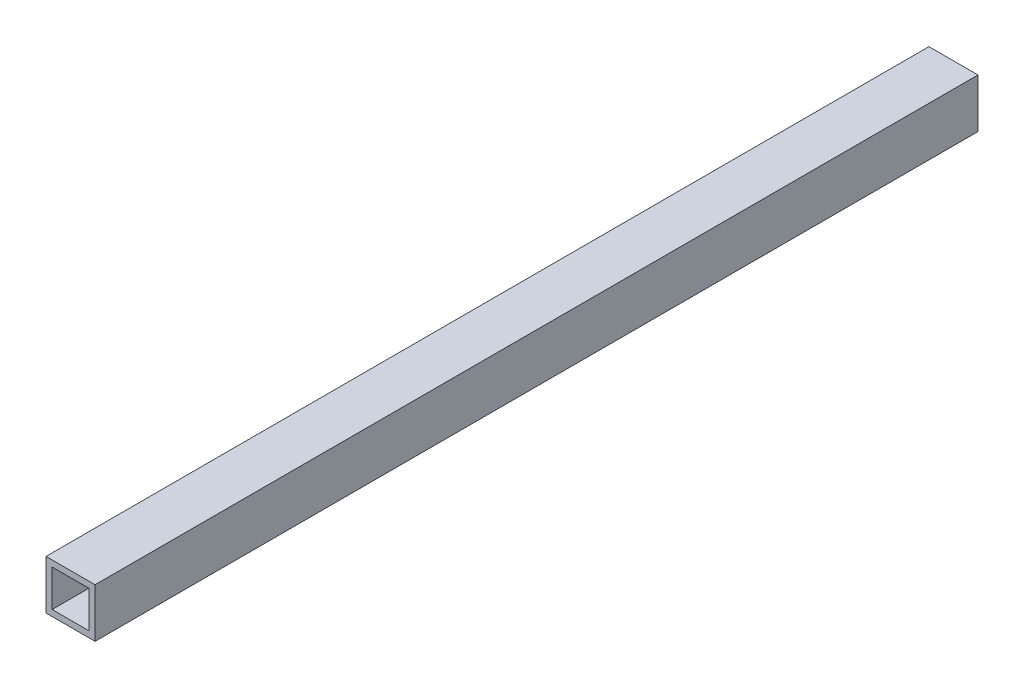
from build123d import *

# Parameters (mm, degrees)
SKETCH1_W          = 25.4
SKETCH1_H          = 25.4
SKETCH1_W_2        = 19.05
SKETCH1_H_2        = 19.05
BASE_EXTRUDE_DEPTH = 457.2


with BuildPart() as part:
    # Sketch1 → Base-Extrude (new body)
    with BuildSketch(Plane.XY):
        with Locations((12.7, 12.7)):
            Rectangle(SKETCH1_W, SKETCH1_H)
        with Locations((12.7, 12.7)):
            Rectangle(SKETCH1_W_2, SKETCH1_H_2, mode=Mode.SUBTRACT)
    extrude(amount=BASE_EXTRUDE_DEPTH)


solid = part.part
